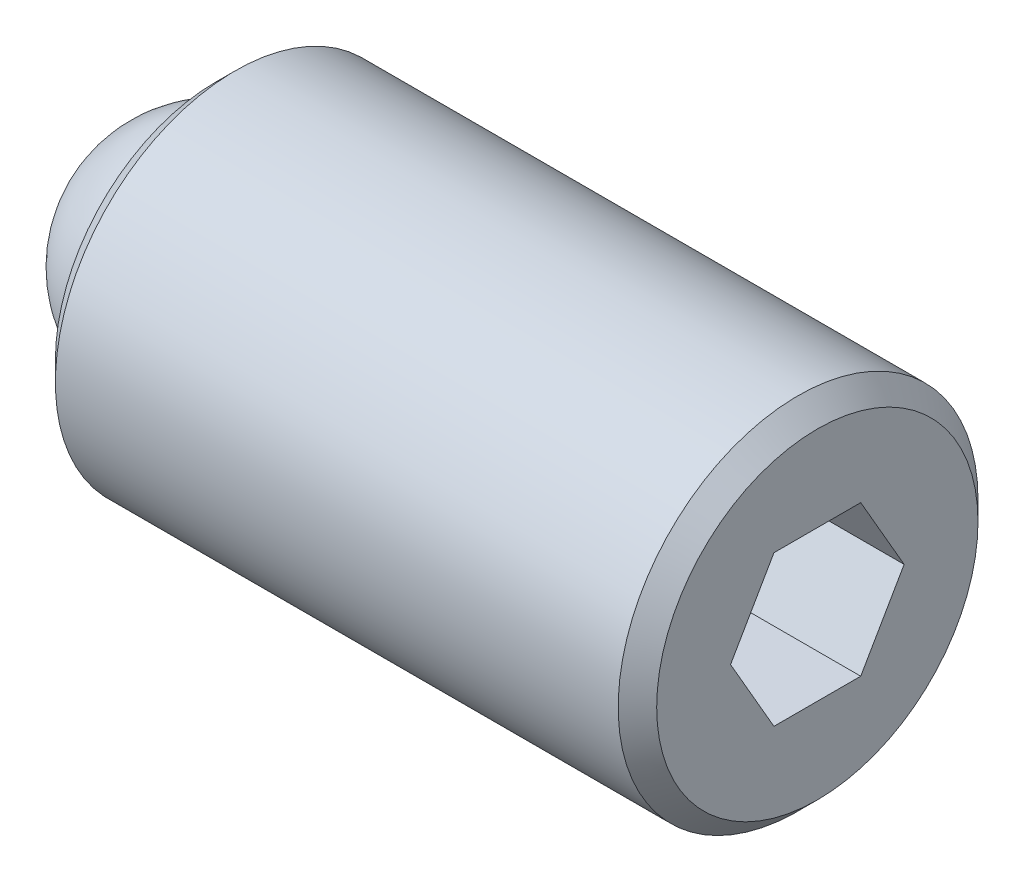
from build123d import *

# Parameters (mm, degrees)
SKETCH2_R           = 2.3749
BOSS_EXTRUDE1_DEPTH = 7.9375
CHAMFER1_SIZE       = 0.254
CHAMFER2_SIZE       = 0.254
CUT_EXTRUDE2_DEPTH  = 2.286
SKETCH3_R           = 1.5875
CUT_EXTRUDE3_DEPTH  = 1.5875


with BuildPart() as part:
    # Sketch2 → Boss-Extrude1 (new body)
    with BuildSketch(Plane(origin=(0, 0, 0), x_dir=(0, 0, -1), z_dir=(1, 0, 0))):
        Circle(SKETCH2_R)
    extrude(amount=BOSS_EXTRUDE1_DEPTH)

    # Chamfer1
    chamfer1_edges = [part.edges().sort_by_distance(p)[0] for p in [
        (0, 0, 2.3749),
    ]]
    chamfer(chamfer1_edges, length=CHAMFER1_SIZE)

    # Chamfer2
    chamfer2_edges = [part.edges().sort_by_distance(p)[0] for p in [
        (7.9375, 0, 2.3749),
    ]]
    chamfer(chamfer2_edges, length=CHAMFER2_SIZE)

    # Sketch4 → Cut-Extrude2 (cut)
    with BuildSketch(Plane(origin=(7.9375, 0, 0), x_dir=(0, 0, -1), z_dir=(1, 0, 0))):
        Polygon((1.14567944, 0), (0.57283972, 0.9921875), (-0.57283972, 0.9921875), (-1.14567944, 0), (-0.57283972, -0.9921875), (0.57283972, -0.9921875), align=None)
    extrude(amount=-CUT_EXTRUDE2_DEPTH, mode=Mode.SUBTRACT)

    # Sketch3 → Cut-Extrude3 (cut)
    with BuildSketch(Plane.ZY):
        Circle(SKETCH3_R)
    extrude(amount=-CUT_EXTRUDE3_DEPTH, mode=Mode.SUBTRACT)


with BuildPart() as body_2:
    # Sketch5 → Revolve1 (revolve)
    with BuildSketch(Plane.ZY):
        with BuildLine():
            Line((0, 0), (0, -1.5875))
            ThreePointArc((0, -1.5875), (-1.5875, 0), (0, 1.5875))
            Line((0, 1.5875), (0, 0))
        make_face()
    revolve(axis=Axis((0, 0, 0), (0, 1, 0)))


solid = Compound([part.part, body_2.part])
